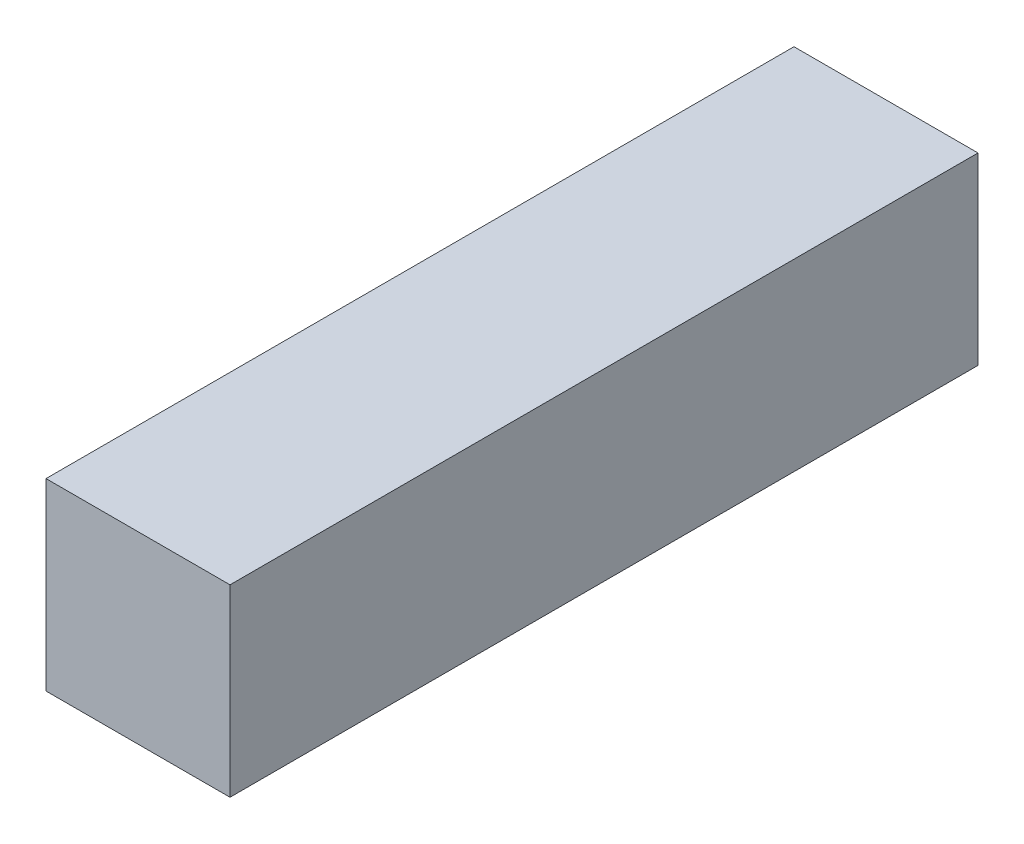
ISO-10303-21;
HEADER;
FILE_DESCRIPTION(('STEP AP214'),'2;1');
FILE_NAME('part.step','',(''),(''),'','','');
FILE_SCHEMA(('AUTOMOTIVE_DESIGN { 1 0 10303 214 1 1 1 1 }'));
ENDSEC;
DATA;
#1=APPLICATION_CONTEXT('core data for automotive mechanical design processes');
#2=APPLICATION_PROTOCOL_DEFINITION('international standard','automotive_design',2000,#1);
#3=PRODUCT_CONTEXT('',#1,'mechanical');
#4=PRODUCT('Part','Part','',(#3));
#5=PRODUCT_RELATED_PRODUCT_CATEGORY('part','',(#4));
#6=PRODUCT_DEFINITION_FORMATION('','',#4);
#7=PRODUCT_DEFINITION_CONTEXT('part definition',#1,'design');
#8=PRODUCT_DEFINITION('design','',#6,#7);
#9=PRODUCT_DEFINITION_SHAPE('','',#8);
#10=(LENGTH_UNIT() NAMED_UNIT(*) SI_UNIT(.MILLI.,.METRE.));
#11=(NAMED_UNIT(*) PLANE_ANGLE_UNIT() SI_UNIT($,.RADIAN.));
#12=(NAMED_UNIT(*) SI_UNIT($,.STERADIAN.) SOLID_ANGLE_UNIT());
#13=UNCERTAINTY_MEASURE_WITH_UNIT(LENGTH_MEASURE(1.E-05),#10,'distance_accuracy_value','');
#14=(GEOMETRIC_REPRESENTATION_CONTEXT(3) GLOBAL_UNCERTAINTY_ASSIGNED_CONTEXT((#13)) GLOBAL_UNIT_ASSIGNED_CONTEXT((#10,
#11,#12)) REPRESENTATION_CONTEXT('',''));
#15=CARTESIAN_POINT('',(0.,0.,0.));
#16=DIRECTION('',(0.,0.,1.));
#17=DIRECTION('',(1.,0.,0.));
#18=AXIS2_PLACEMENT_3D('',#15,#16,#17);
#19=CARTESIAN_POINT('',(2.,-0.428969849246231,101.879296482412));
#20=DIRECTION('',(0.,0.,-1.));
#21=DIRECTION('',(-1.,0.,0.));
#22=AXIS2_PLACEMENT_3D('',#19,#20,#21);
#23=PLANE('',#22);
#24=DIRECTION('',(0.,-1.,0.));
#25=VECTOR('',#24,1.);
#26=CARTESIAN_POINT('',(0.,-0.428969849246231,101.879296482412));
#27=LINE('',#26,#25);
#28=CARTESIAN_POINT('',(0.,1.57103015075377,101.879296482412));
#29=VERTEX_POINT('',#28);
#30=CARTESIAN_POINT('',(0.,-0.428969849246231,101.879296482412));
#31=VERTEX_POINT('',#30);
#32=EDGE_CURVE('E96',#29,#31,#27,.T.);
#33=ORIENTED_EDGE('',*,*,#32,.T.);
#34=DIRECTION('',(-1.,0.,0.));
#35=VECTOR('',#34,1.);
#36=CARTESIAN_POINT('',(2.,-0.428969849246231,101.879296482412));
#37=LINE('',#36,#35);
#38=CARTESIAN_POINT('',(2.,-0.428969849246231,101.879296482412));
#39=VERTEX_POINT('',#38);
#40=EDGE_CURVE('E11',#39,#31,#37,.T.);
#41=ORIENTED_EDGE('',*,*,#40,.F.);
#42=DIRECTION('',(0.,-1.,0.));
#43=VECTOR('',#42,1.);
#44=CARTESIAN_POINT('',(2.,-0.428969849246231,101.879296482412));
#45=LINE('',#44,#43);
#46=CARTESIAN_POINT('',(2.,1.57103015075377,101.879296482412));
#47=VERTEX_POINT('',#46);
#48=EDGE_CURVE('E84',#47,#39,#45,.T.);
#49=ORIENTED_EDGE('',*,*,#48,.F.);
#50=DIRECTION('',(-1.,0.,0.));
#51=VECTOR('',#50,1.);
#52=CARTESIAN_POINT('',(2.,1.57103015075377,101.879296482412));
#53=LINE('',#52,#51);
#54=EDGE_CURVE('E92',#47,#29,#53,.T.);
#55=ORIENTED_EDGE('',*,*,#54,.T.);
#56=EDGE_LOOP('',(#33,#41,#49,#55));
#57=FACE_BOUND('',#56,.T.);
#58=ADVANCED_FACE('F33',(#57),#23,.F.);
#59=CARTESIAN_POINT('',(2.,-0.428969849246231,101.879296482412));
#60=DIRECTION('',(0.,1.,0.));
#61=DIRECTION('',(0.,0.,1.));
#62=AXIS2_PLACEMENT_3D('',#59,#60,#61);
#63=PLANE('',#62);
#64=DIRECTION('',(0.,0.,-1.));
#65=VECTOR('',#64,1.);
#66=CARTESIAN_POINT('',(0.,-0.428969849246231,101.879296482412));
#67=LINE('',#66,#65);
#68=CARTESIAN_POINT('',(0.,-0.42896984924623,93.7492964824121));
#69=VERTEX_POINT('',#68);
#70=EDGE_CURVE('E88',#31,#69,#67,.T.);
#71=ORIENTED_EDGE('',*,*,#70,.T.);
#72=DIRECTION('',(-1.,0.,0.));
#73=VECTOR('',#72,1.);
#74=CARTESIAN_POINT('',(2.,-0.42896984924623,93.7492964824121));
#75=LINE('',#74,#73);
#76=CARTESIAN_POINT('',(2.,-0.42896984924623,93.7492964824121));
#77=VERTEX_POINT('',#76);
#78=EDGE_CURVE('E41',#77,#69,#75,.T.);
#79=ORIENTED_EDGE('',*,*,#78,.F.);
#80=DIRECTION('',(0.,0.,-1.));
#81=VECTOR('',#80,1.);
#82=CARTESIAN_POINT('',(2.,-0.428969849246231,101.879296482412));
#83=LINE('',#82,#81);
#84=EDGE_CURVE('E79',#39,#77,#83,.T.);
#85=ORIENTED_EDGE('',*,*,#84,.F.);
#86=ORIENTED_EDGE('',*,*,#40,.T.);
#87=EDGE_LOOP('',(#71,#79,#85,#86));
#88=FACE_BOUND('',#87,.T.);
#89=ADVANCED_FACE('F87',(#88),#63,.F.);
#90=CARTESIAN_POINT('',(2.,-0.42896984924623,93.7492964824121));
#91=DIRECTION('',(0.,0.,1.));
#92=DIRECTION('',(1.,0.,0.));
#93=AXIS2_PLACEMENT_3D('',#90,#91,#92);
#94=PLANE('',#93);
#95=DIRECTION('',(0.,1.,0.));
#96=VECTOR('',#95,1.);
#97=CARTESIAN_POINT('',(0.,-0.42896984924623,93.7492964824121));
#98=LINE('',#97,#96);
#99=CARTESIAN_POINT('',(0.,1.57103015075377,93.7492964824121));
#100=VERTEX_POINT('',#99);
#101=EDGE_CURVE('E66',#69,#100,#98,.T.);
#102=ORIENTED_EDGE('',*,*,#101,.T.);
#103=DIRECTION('',(-1.,0.,0.));
#104=VECTOR('',#103,1.);
#105=CARTESIAN_POINT('',(2.,1.57103015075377,93.7492964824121));
#106=LINE('',#105,#104);
#107=CARTESIAN_POINT('',(2.,1.57103015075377,93.7492964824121));
#108=VERTEX_POINT('',#107);
#109=EDGE_CURVE('E89',#108,#100,#106,.T.);
#110=ORIENTED_EDGE('',*,*,#109,.F.);
#111=DIRECTION('',(0.,1.,0.));
#112=VECTOR('',#111,1.);
#113=CARTESIAN_POINT('',(2.,-0.42896984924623,93.7492964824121));
#114=LINE('',#113,#112);
#115=EDGE_CURVE('E82',#77,#108,#114,.T.);
#116=ORIENTED_EDGE('',*,*,#115,.F.);
#117=ORIENTED_EDGE('',*,*,#78,.T.);
#118=EDGE_LOOP('',(#102,#110,#116,#117));
#119=FACE_BOUND('',#118,.T.);
#120=ADVANCED_FACE('F90',(#119),#94,.F.);
#121=CARTESIAN_POINT('',(2.,1.57103015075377,101.879296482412));
#122=DIRECTION('',(0.,-1.,0.));
#123=DIRECTION('',(0.,0.,-1.));
#124=AXIS2_PLACEMENT_3D('',#121,#122,#123);
#125=PLANE('',#124);
#126=DIRECTION('',(0.,0.,1.));
#127=VECTOR('',#126,1.);
#128=CARTESIAN_POINT('',(0.,1.57103015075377,101.879296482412));
#129=LINE('',#128,#127);
#130=EDGE_CURVE('E72',#100,#29,#129,.T.);
#131=ORIENTED_EDGE('',*,*,#130,.T.);
#132=ORIENTED_EDGE('',*,*,#54,.F.);
#133=DIRECTION('',(0.,0.,1.));
#134=VECTOR('',#133,1.);
#135=CARTESIAN_POINT('',(2.,1.57103015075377,101.879296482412));
#136=LINE('',#135,#134);
#137=EDGE_CURVE('E49',#108,#47,#136,.T.);
#138=ORIENTED_EDGE('',*,*,#137,.F.);
#139=ORIENTED_EDGE('',*,*,#109,.T.);
#140=EDGE_LOOP('',(#131,#132,#138,#139));
#141=FACE_BOUND('',#140,.T.);
#142=ADVANCED_FACE('F103',(#141),#125,.F.);
#143=CARTESIAN_POINT('',(2.,0.,0.));
#144=DIRECTION('',(-1.,0.,0.));
#145=DIRECTION('',(0.,0.,1.));
#146=AXIS2_PLACEMENT_3D('',#143,#144,#145);
#147=PLANE('',#146);
#148=ORIENTED_EDGE('',*,*,#48,.T.);
#149=ORIENTED_EDGE('',*,*,#84,.T.);
#150=ORIENTED_EDGE('',*,*,#115,.T.);
#151=ORIENTED_EDGE('',*,*,#137,.T.);
#152=EDGE_LOOP('',(#148,#149,#150,#151));
#153=FACE_BOUND('',#152,.T.);
#154=ADVANCED_FACE('F80',(#153),#147,.F.);
#155=CARTESIAN_POINT('',(0.,0.,0.));
#156=DIRECTION('',(-1.,0.,0.));
#157=DIRECTION('',(0.,0.,1.));
#158=AXIS2_PLACEMENT_3D('',#155,#156,#157);
#159=PLANE('',#158);
#160=ORIENTED_EDGE('',*,*,#32,.F.);
#161=ORIENTED_EDGE('',*,*,#130,.F.);
#162=ORIENTED_EDGE('',*,*,#101,.F.);
#163=ORIENTED_EDGE('',*,*,#70,.F.);
#164=EDGE_LOOP('',(#160,#161,#162,#163));
#165=FACE_BOUND('',#164,.T.);
#166=ADVANCED_FACE('F106',(#165),#159,.T.);
#167=CLOSED_SHELL('',(#58,#89,#120,#142,#154,#166));
#168=MANIFOLD_SOLID_BREP('B2',#167);
#169=ADVANCED_BREP_SHAPE_REPRESENTATION('',(#18,#168),#14);
#170=SHAPE_DEFINITION_REPRESENTATION(#9,#169);
ENDSEC;
END-ISO-10303-21;
